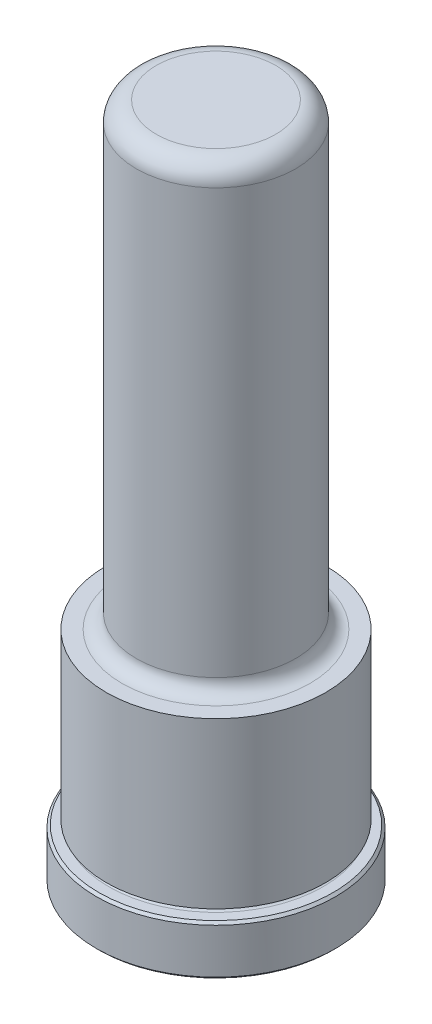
from build123d import *

# Parameters (mm, degrees)
CHAMFER1_SIZE = 0.381
FILLET7_R     = 3.175


with BuildPart() as part:
    # Sketch1 → Revolve1 (revolve)
    with BuildSketch(Plane(origin=(0, 0, 0), x_dir=(0, 0, -1), z_dir=(1, 0, 0)), mode=Mode.PRIVATE) as revolve1_sk:
        with BuildLine():
            Line((0, 0), (19.05, 0))
            Line((19.05, 0), (19.05, 7.9248))
            Line((19.05, 7.9248), (17.0688, 7.9248))
            ThreePointArc((17.0688, 7.9248), (16.6878, 8.3058), (17.0688, 8.6868))
            Line((17.0688, 8.6868), (17.4752, 8.6868))
            Line((17.4752, 8.6868), (17.4752, 34.925))
            Line((17.4752, 34.925), (14.9733, 34.925))
            ThreePointArc((14.9733, 34.925), (13.356853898, 35.594553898), (12.6873, 37.211))
            Line((12.6873, 37.211), (12.6873, 107.95))
            Line((12.6873, 107.95), (0, 107.95))
            Line((0, 107.95), (0, 0))
        make_face()
    revolve(revolve1_sk.sketch.rotate(Axis((0, 0, 0), (0, -1, 0)), 180), axis=Axis((0, 0, 0), (0, -1, 0)))

    # Chamfer1
    chamfer1_edges = [part.edges().sort_by_distance(p)[0] for p in [
        (0, 7.9248, -19.05),
        (0, 0, -19.05),
    ]]
    chamfer(chamfer1_edges, length=CHAMFER1_SIZE)

    # Fillet7
    fillet7_edges = [part.edges().sort_by_distance(p)[0] for p in [
        (0, 107.95, -12.6873),
    ]]
    fillet(fillet7_edges, radius=FILLET7_R)


solid = part.part
